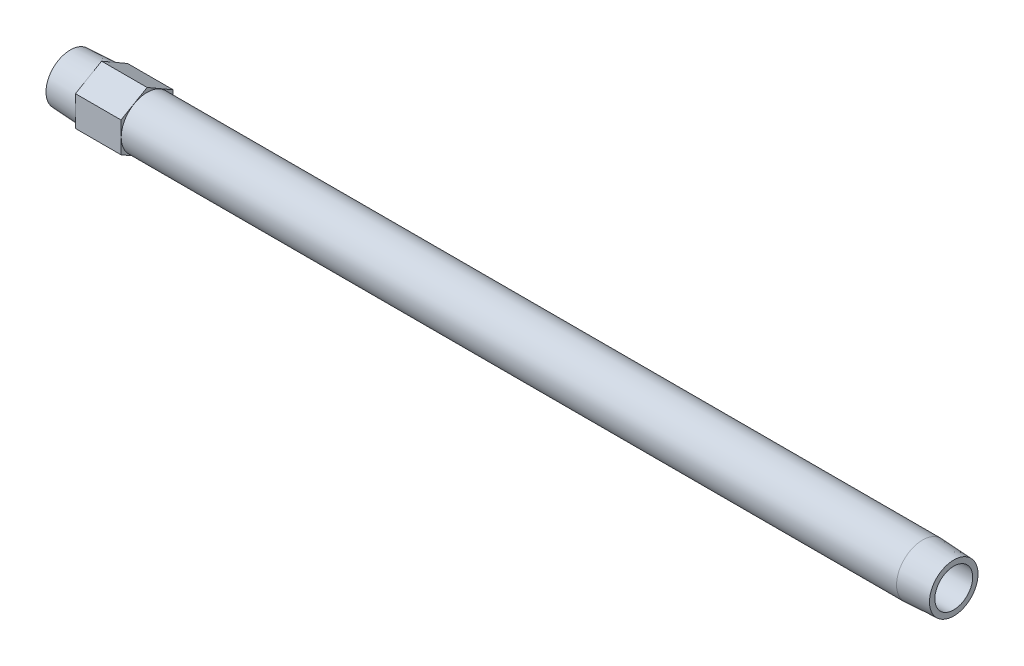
ISO-10303-21;
HEADER;
FILE_DESCRIPTION(('STEP AP214'),'2;1');
FILE_NAME('part.step','',(''),(''),'','','');
FILE_SCHEMA(('AUTOMOTIVE_DESIGN { 1 0 10303 214 1 1 1 1 }'));
ENDSEC;
DATA;
#1=APPLICATION_CONTEXT('core data for automotive mechanical design processes');
#2=APPLICATION_PROTOCOL_DEFINITION('international standard','automotive_design',2000,#1);
#3=PRODUCT_CONTEXT('',#1,'mechanical');
#4=PRODUCT('Part','Part','',(#3));
#5=PRODUCT_RELATED_PRODUCT_CATEGORY('part','',(#4));
#6=PRODUCT_DEFINITION_FORMATION('','',#4);
#7=PRODUCT_DEFINITION_CONTEXT('part definition',#1,'design');
#8=PRODUCT_DEFINITION('design','',#6,#7);
#9=PRODUCT_DEFINITION_SHAPE('','',#8);
#10=(LENGTH_UNIT() NAMED_UNIT(*) SI_UNIT(.MILLI.,.METRE.));
#11=(NAMED_UNIT(*) PLANE_ANGLE_UNIT() SI_UNIT($,.RADIAN.));
#12=(NAMED_UNIT(*) SI_UNIT($,.STERADIAN.) SOLID_ANGLE_UNIT());
#13=UNCERTAINTY_MEASURE_WITH_UNIT(LENGTH_MEASURE(1.E-05),#10,'distance_accuracy_value','');
#14=(GEOMETRIC_REPRESENTATION_CONTEXT(3) GLOBAL_UNCERTAINTY_ASSIGNED_CONTEXT((#13)) GLOBAL_UNIT_ASSIGNED_CONTEXT((#10,
#11,#12)) REPRESENTATION_CONTEXT('',''));
#15=CARTESIAN_POINT('',(0.,0.,0.));
#16=DIRECTION('',(0.,0.,1.));
#17=DIRECTION('',(1.,0.,0.));
#18=AXIS2_PLACEMENT_3D('',#15,#16,#17);
#19=CARTESIAN_POINT('',(0.,0.,-8.03071885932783));
#20=DIRECTION('',(1.,0.,0.));
#21=DIRECTION('',(0.,0.,-1.));
#22=AXIS2_PLACEMENT_3D('',#19,#20,#21);
#23=PLANE('',#22);
#24=CARTESIAN_POINT('',(0.,0.,0.));
#25=DIRECTION('',(-1.,0.,0.));
#26=DIRECTION('',(0.,0.,1.));
#27=AXIS2_PLACEMENT_3D('',#24,#25,#26);
#28=CIRCLE('',#27,8.03071885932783);
#29=CARTESIAN_POINT('',(0.,0.,8.03071885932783));
#30=VERTEX_POINT('',#29);
#31=EDGE_CURVE('E147',#30,#30,#28,.T.);
#32=ORIENTED_EDGE('',*,*,#31,.T.);
#33=EDGE_LOOP('',(#32));
#34=FACE_BOUND('',#33,.T.);
#35=CARTESIAN_POINT('',(0.,0.,0.));
#36=DIRECTION('',(1.,0.,0.));
#37=DIRECTION('',(0.,0.,1.));
#38=AXIS2_PLACEMENT_3D('',#35,#36,#37);
#39=CIRCLE('',#38,6.2611);
#40=CARTESIAN_POINT('',(0.,0.,6.2611));
#41=VERTEX_POINT('',#40);
#42=EDGE_CURVE('E159',#41,#41,#39,.T.);
#43=ORIENTED_EDGE('',*,*,#42,.T.);
#44=EDGE_LOOP('',(#43));
#45=FACE_BOUND('',#44,.T.);
#46=ADVANCED_FACE('F15',(#34,#45),#23,.F.);
#47=CARTESIAN_POINT('',(292.1,0.,-8.03071885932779));
#48=DIRECTION('',(-1.,0.,0.));
#49=DIRECTION('',(0.,0.,1.));
#50=AXIS2_PLACEMENT_3D('',#47,#48,#49);
#51=PLANE('',#50);
#52=CARTESIAN_POINT('',(292.1,0.,0.));
#53=DIRECTION('',(-1.,0.,0.));
#54=DIRECTION('',(0.,0.,1.));
#55=AXIS2_PLACEMENT_3D('',#52,#53,#54);
#56=CIRCLE('',#55,8.03071885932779);
#57=CARTESIAN_POINT('',(292.1,0.,8.03071885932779));
#58=VERTEX_POINT('',#57);
#59=EDGE_CURVE('E150',#58,#58,#56,.T.);
#60=ORIENTED_EDGE('',*,*,#59,.F.);
#61=EDGE_LOOP('',(#60));
#62=FACE_BOUND('',#61,.T.);
#63=CARTESIAN_POINT('',(292.1,0.,0.));
#64=DIRECTION('',(-1.,0.,0.));
#65=DIRECTION('',(0.,0.,1.));
#66=AXIS2_PLACEMENT_3D('',#63,#64,#65);
#67=CIRCLE('',#66,6.2611);
#68=CARTESIAN_POINT('',(292.1,0.,6.2611));
#69=VERTEX_POINT('',#68);
#70=EDGE_CURVE('E156',#69,#69,#67,.F.);
#71=ORIENTED_EDGE('',*,*,#70,.F.);
#72=EDGE_LOOP('',(#71));
#73=FACE_BOUND('',#72,.T.);
#74=ADVANCED_FACE('F178',(#62,#73),#51,.F.);
#75=CARTESIAN_POINT('',(25.4,-4.9859969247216,-8.636));
#76=DIRECTION('',(1.,0.,0.));
#77=DIRECTION('',(0.,1.,0.));
#78=AXIS2_PLACEMENT_3D('',#75,#76,#77);
#79=PLANE('',#78);
#80=DIRECTION('',(0.,0.5,-0.866025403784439));
#81=VECTOR('',#80,1.);
#82=CARTESIAN_POINT('',(25.4,-9.97199384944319,0.));
#83=LINE('',#82,#81);
#84=CARTESIAN_POINT('',(25.4,-9.97199384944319,0.));
#85=VERTEX_POINT('',#84);
#86=CARTESIAN_POINT('',(25.4,-4.9859969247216,-8.636));
#87=VERTEX_POINT('',#86);
#88=EDGE_CURVE('E103',#85,#87,#83,.T.);
#89=ORIENTED_EDGE('',*,*,#88,.T.);
#90=DIRECTION('',(0.,1.,0.));
#91=VECTOR('',#90,1.);
#92=CARTESIAN_POINT('',(25.4,-4.9859969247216,-8.636));
#93=LINE('',#92,#91);
#94=CARTESIAN_POINT('',(25.4,4.9859969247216,-8.636));
#95=VERTEX_POINT('',#94);
#96=EDGE_CURVE('E83',#87,#95,#93,.T.);
#97=ORIENTED_EDGE('',*,*,#96,.T.);
#98=DIRECTION('',(0.,0.5,0.866025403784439));
#99=VECTOR('',#98,1.);
#100=CARTESIAN_POINT('',(25.4,4.9859969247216,-8.636));
#101=LINE('',#100,#99);
#102=CARTESIAN_POINT('',(25.4,9.97199384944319,0.));
#103=VERTEX_POINT('',#102);
#104=EDGE_CURVE('E102',#95,#103,#101,.T.);
#105=ORIENTED_EDGE('',*,*,#104,.T.);
#106=DIRECTION('',(0.,-0.5,0.866025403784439));
#107=VECTOR('',#106,1.);
#108=CARTESIAN_POINT('',(25.4,9.97199384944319,0.));
#109=LINE('',#108,#107);
#110=CARTESIAN_POINT('',(25.4,4.9859969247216,8.636));
#111=VERTEX_POINT('',#110);
#112=EDGE_CURVE('E105',#103,#111,#109,.T.);
#113=ORIENTED_EDGE('',*,*,#112,.T.);
#114=DIRECTION('',(0.,-1.,0.));
#115=VECTOR('',#114,1.);
#116=CARTESIAN_POINT('',(25.4,4.9859969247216,8.636));
#117=LINE('',#116,#115);
#118=CARTESIAN_POINT('',(25.4,-4.9859969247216,8.636));
#119=VERTEX_POINT('',#118);
#120=EDGE_CURVE('E35',#111,#119,#117,.T.);
#121=ORIENTED_EDGE('',*,*,#120,.T.);
#122=DIRECTION('',(0.,-0.5,-0.866025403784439));
#123=VECTOR('',#122,1.);
#124=CARTESIAN_POINT('',(25.4,-4.9859969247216,8.636));
#125=LINE('',#124,#123);
#126=EDGE_CURVE('E30',#119,#85,#125,.T.);
#127=ORIENTED_EDGE('',*,*,#126,.T.);
#128=EDGE_LOOP('',(#89,#97,#105,#113,#121,#127));
#129=FACE_BOUND('',#128,.T.);
#130=CARTESIAN_POINT('',(25.4,0.,0.));
#131=DIRECTION('',(1.,0.,0.));
#132=DIRECTION('',(0.,1.,0.));
#133=AXIS2_PLACEMENT_3D('',#130,#131,#132);
#134=CIRCLE('',#133,8.5725);
#135=CARTESIAN_POINT('',(25.4,8.5725,0.));
#136=VERTEX_POINT('',#135);
#137=EDGE_CURVE('E89',#136,#136,#134,.F.);
#138=ORIENTED_EDGE('',*,*,#137,.T.);
#139=EDGE_LOOP('',(#138));
#140=FACE_BOUND('',#139,.T.);
#141=ADVANCED_FACE('F124',(#129,#140),#79,.T.);
#142=CARTESIAN_POINT('',(10.3378,-4.9859969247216,-8.636));
#143=DIRECTION('',(1.,0.,0.));
#144=DIRECTION('',(0.,1.,0.));
#145=AXIS2_PLACEMENT_3D('',#142,#143,#144);
#146=PLANE('',#145);
#147=DIRECTION('',(0.,0.5,-0.866025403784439));
#148=VECTOR('',#147,1.);
#149=CARTESIAN_POINT('',(10.3378,-9.97199384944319,0.));
#150=LINE('',#149,#148);
#151=CARTESIAN_POINT('',(10.3378,-9.97199384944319,0.));
#152=VERTEX_POINT('',#151);
#153=CARTESIAN_POINT('',(10.3378,-4.9859969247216,-8.636));
#154=VERTEX_POINT('',#153);
#155=EDGE_CURVE('E73',#152,#154,#150,.T.);
#156=ORIENTED_EDGE('',*,*,#155,.F.);
#157=DIRECTION('',(0.,-0.5,-0.866025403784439));
#158=VECTOR('',#157,1.);
#159=CARTESIAN_POINT('',(10.3378,-4.9859969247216,8.636));
#160=LINE('',#159,#158);
#161=CARTESIAN_POINT('',(10.3378,-4.9859969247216,8.636));
#162=VERTEX_POINT('',#161);
#163=EDGE_CURVE('E99',#162,#152,#160,.T.);
#164=ORIENTED_EDGE('',*,*,#163,.F.);
#165=DIRECTION('',(0.,-1.,0.));
#166=VECTOR('',#165,1.);
#167=CARTESIAN_POINT('',(10.3378,4.9859969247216,8.636));
#168=LINE('',#167,#166);
#169=CARTESIAN_POINT('',(10.3378,4.9859969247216,8.636));
#170=VERTEX_POINT('',#169);
#171=EDGE_CURVE('E133',#170,#162,#168,.T.);
#172=ORIENTED_EDGE('',*,*,#171,.F.);
#173=DIRECTION('',(0.,-0.5,0.866025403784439));
#174=VECTOR('',#173,1.);
#175=CARTESIAN_POINT('',(10.3378,9.97199384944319,0.));
#176=LINE('',#175,#174);
#177=CARTESIAN_POINT('',(10.3378,9.97199384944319,0.));
#178=VERTEX_POINT('',#177);
#179=EDGE_CURVE('E129',#178,#170,#176,.T.);
#180=ORIENTED_EDGE('',*,*,#179,.F.);
#181=DIRECTION('',(0.,0.5,0.866025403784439));
#182=VECTOR('',#181,1.);
#183=CARTESIAN_POINT('',(10.3378,4.9859969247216,-8.636));
#184=LINE('',#183,#182);
#185=CARTESIAN_POINT('',(10.3378,4.9859969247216,-8.636));
#186=VERTEX_POINT('',#185);
#187=EDGE_CURVE('E75',#186,#178,#184,.T.);
#188=ORIENTED_EDGE('',*,*,#187,.F.);
#189=DIRECTION('',(0.,1.,0.));
#190=VECTOR('',#189,1.);
#191=CARTESIAN_POINT('',(10.3378,-4.9859969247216,-8.636));
#192=LINE('',#191,#190);
#193=EDGE_CURVE('E68',#154,#186,#192,.T.);
#194=ORIENTED_EDGE('',*,*,#193,.F.);
#195=EDGE_LOOP('',(#156,#164,#172,#180,#188,#194));
#196=FACE_BOUND('',#195,.T.);
#197=CARTESIAN_POINT('',(10.3378,0.,0.));
#198=DIRECTION('',(-1.,0.,0.));
#199=DIRECTION('',(0.,0.,1.));
#200=AXIS2_PLACEMENT_3D('',#197,#198,#199);
#201=CIRCLE('',#200,8.5725);
#202=CARTESIAN_POINT('',(10.3378,0.,8.5725));
#203=VERTEX_POINT('',#202);
#204=EDGE_CURVE('E95',#203,#203,#201,.T.);
#205=ORIENTED_EDGE('',*,*,#204,.F.);
#206=EDGE_LOOP('',(#205));
#207=FACE_BOUND('',#206,.T.);
#208=ADVANCED_FACE('F69',(#196,#207),#146,.F.);
#209=CARTESIAN_POINT('',(25.4,-9.97199384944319,0.));
#210=DIRECTION('',(0.,0.866025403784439,0.5));
#211=DIRECTION('',(0.,-0.5,0.866025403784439));
#212=AXIS2_PLACEMENT_3D('',#209,#210,#211);
#213=PLANE('',#212);
#214=ORIENTED_EDGE('',*,*,#155,.T.);
#215=DIRECTION('',(-1.,0.,0.));
#216=VECTOR('',#215,1.);
#217=CARTESIAN_POINT('',(25.4,-4.9859969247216,-8.636));
#218=LINE('',#217,#216);
#219=EDGE_CURVE('E10',#87,#154,#218,.T.);
#220=ORIENTED_EDGE('',*,*,#219,.F.);
#221=ORIENTED_EDGE('',*,*,#88,.F.);
#222=DIRECTION('',(-1.,0.,0.));
#223=VECTOR('',#222,1.);
#224=CARTESIAN_POINT('',(25.4,-9.97199384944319,0.));
#225=LINE('',#224,#223);
#226=EDGE_CURVE('E87',#85,#152,#225,.T.);
#227=ORIENTED_EDGE('',*,*,#226,.T.);
#228=EDGE_LOOP('',(#214,#220,#221,#227));
#229=FACE_BOUND('',#228,.T.);
#230=ADVANCED_FACE('F17',(#229),#213,.F.);
#231=CARTESIAN_POINT('',(25.4,-4.9859969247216,-8.636));
#232=DIRECTION('',(0.,0.,1.));
#233=DIRECTION('',(1.,0.,0.));
#234=AXIS2_PLACEMENT_3D('',#231,#232,#233);
#235=PLANE('',#234);
#236=ORIENTED_EDGE('',*,*,#193,.T.);
#237=DIRECTION('',(-1.,0.,0.));
#238=VECTOR('',#237,1.);
#239=CARTESIAN_POINT('',(25.4,4.9859969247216,-8.636));
#240=LINE('',#239,#238);
#241=EDGE_CURVE('E23',#95,#186,#240,.T.);
#242=ORIENTED_EDGE('',*,*,#241,.F.);
#243=ORIENTED_EDGE('',*,*,#96,.F.);
#244=ORIENTED_EDGE('',*,*,#219,.T.);
#245=EDGE_LOOP('',(#236,#242,#243,#244));
#246=FACE_BOUND('',#245,.T.);
#247=ADVANCED_FACE('F82',(#246),#235,.F.);
#248=CARTESIAN_POINT('',(25.4,4.9859969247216,-8.636));
#249=DIRECTION('',(0.,-0.866025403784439,0.5));
#250=DIRECTION('',(0.,-0.5,-0.866025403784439));
#251=AXIS2_PLACEMENT_3D('',#248,#249,#250);
#252=PLANE('',#251);
#253=ORIENTED_EDGE('',*,*,#187,.T.);
#254=DIRECTION('',(-1.,0.,0.));
#255=VECTOR('',#254,1.);
#256=CARTESIAN_POINT('',(25.4,9.97199384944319,0.));
#257=LINE('',#256,#255);
#258=EDGE_CURVE('E117',#103,#178,#257,.T.);
#259=ORIENTED_EDGE('',*,*,#258,.F.);
#260=ORIENTED_EDGE('',*,*,#104,.F.);
#261=ORIENTED_EDGE('',*,*,#241,.T.);
#262=EDGE_LOOP('',(#253,#259,#260,#261));
#263=FACE_BOUND('',#262,.T.);
#264=ADVANCED_FACE('F121',(#263),#252,.F.);
#265=CARTESIAN_POINT('',(25.4,9.97199384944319,0.));
#266=DIRECTION('',(0.,-0.866025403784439,-0.5));
#267=DIRECTION('',(0.,0.5,-0.866025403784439));
#268=AXIS2_PLACEMENT_3D('',#265,#266,#267);
#269=PLANE('',#268);
#270=ORIENTED_EDGE('',*,*,#179,.T.);
#271=DIRECTION('',(-1.,0.,0.));
#272=VECTOR('',#271,1.);
#273=CARTESIAN_POINT('',(25.4,4.9859969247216,8.636));
#274=LINE('',#273,#272);
#275=EDGE_CURVE('E114',#111,#170,#274,.T.);
#276=ORIENTED_EDGE('',*,*,#275,.F.);
#277=ORIENTED_EDGE('',*,*,#112,.F.);
#278=ORIENTED_EDGE('',*,*,#258,.T.);
#279=EDGE_LOOP('',(#270,#276,#277,#278));
#280=FACE_BOUND('',#279,.T.);
#281=ADVANCED_FACE('F128',(#280),#269,.F.);
#282=CARTESIAN_POINT('',(25.4,4.9859969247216,8.636));
#283=DIRECTION('',(0.,0.,-1.));
#284=DIRECTION('',(-1.,0.,0.));
#285=AXIS2_PLACEMENT_3D('',#282,#283,#284);
#286=PLANE('',#285);
#287=ORIENTED_EDGE('',*,*,#171,.T.);
#288=DIRECTION('',(-1.,0.,0.));
#289=VECTOR('',#288,1.);
#290=CARTESIAN_POINT('',(25.4,-4.9859969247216,8.636));
#291=LINE('',#290,#289);
#292=EDGE_CURVE('E111',#119,#162,#291,.T.);
#293=ORIENTED_EDGE('',*,*,#292,.F.);
#294=ORIENTED_EDGE('',*,*,#120,.F.);
#295=ORIENTED_EDGE('',*,*,#275,.T.);
#296=EDGE_LOOP('',(#287,#293,#294,#295));
#297=FACE_BOUND('',#296,.T.);
#298=ADVANCED_FACE('F132',(#297),#286,.F.);
#299=CARTESIAN_POINT('',(25.4,-4.9859969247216,8.636));
#300=DIRECTION('',(0.,0.866025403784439,-0.5));
#301=DIRECTION('',(0.,0.5,0.866025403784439));
#302=AXIS2_PLACEMENT_3D('',#299,#300,#301);
#303=PLANE('',#302);
#304=ORIENTED_EDGE('',*,*,#163,.T.);
#305=ORIENTED_EDGE('',*,*,#226,.F.);
#306=ORIENTED_EDGE('',*,*,#126,.F.);
#307=ORIENTED_EDGE('',*,*,#292,.T.);
#308=EDGE_LOOP('',(#304,#305,#306,#307));
#309=FACE_BOUND('',#308,.T.);
#310=ADVANCED_FACE('F135',(#309),#303,.F.);
#311=CARTESIAN_POINT('',(10.3378,0.,0.));
#312=DIRECTION('',(1.,0.,0.));
#313=DIRECTION('',(0.,0.,-1.));
#314=AXIS2_PLACEMENT_3D('',#311,#312,#313);
#315=CONICAL_SURFACE('',#314,8.5725,0.0523598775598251);
#316=ORIENTED_EDGE('',*,*,#31,.F.);
#317=EDGE_LOOP('',(#316));
#318=FACE_BOUND('',#317,.T.);
#319=ORIENTED_EDGE('',*,*,#204,.T.);
#320=EDGE_LOOP('',(#319));
#321=FACE_BOUND('',#320,.T.);
#322=ADVANCED_FACE('F187',(#318,#321),#315,.T.);
#323=CARTESIAN_POINT('',(-60.,0.,0.));
#324=DIRECTION('',(-1.,0.,0.));
#325=DIRECTION('',(0.,0.,1.));
#326=AXIS2_PLACEMENT_3D('',#323,#324,#325);
#327=CYLINDRICAL_SURFACE('',#326,8.5725);
#328=ORIENTED_EDGE('',*,*,#137,.F.);
#329=EDGE_LOOP('',(#328));
#330=FACE_BOUND('',#329,.T.);
#331=CARTESIAN_POINT('',(281.7622,0.,0.));
#332=DIRECTION('',(-1.,0.,0.));
#333=DIRECTION('',(0.,0.,1.));
#334=AXIS2_PLACEMENT_3D('',#331,#332,#333);
#335=CIRCLE('',#334,8.5725);
#336=CARTESIAN_POINT('',(281.7622,0.,8.5725));
#337=VERTEX_POINT('',#336);
#338=EDGE_CURVE('E153',#337,#337,#335,.T.);
#339=ORIENTED_EDGE('',*,*,#338,.T.);
#340=EDGE_LOOP('',(#339));
#341=FACE_BOUND('',#340,.T.);
#342=ADVANCED_FACE('F174',(#330,#341),#327,.T.);
#343=CARTESIAN_POINT('',(292.1,0.,0.));
#344=DIRECTION('',(-1.,0.,0.));
#345=DIRECTION('',(0.,0.,1.));
#346=AXIS2_PLACEMENT_3D('',#343,#344,#345);
#347=CONICAL_SURFACE('',#346,8.03071885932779,0.052359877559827);
#348=ORIENTED_EDGE('',*,*,#338,.F.);
#349=EDGE_LOOP('',(#348));
#350=FACE_BOUND('',#349,.T.);
#351=ORIENTED_EDGE('',*,*,#59,.T.);
#352=EDGE_LOOP('',(#351));
#353=FACE_BOUND('',#352,.T.);
#354=ADVANCED_FACE('F167',(#350,#353),#347,.T.);
#355=CARTESIAN_POINT('',(293.289097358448,0.,0.));
#356=DIRECTION('',(-1.,0.,0.));
#357=DIRECTION('',(0.,0.,1.));
#358=AXIS2_PLACEMENT_3D('',#355,#356,#357);
#359=CYLINDRICAL_SURFACE('',#358,6.2611);
#360=ORIENTED_EDGE('',*,*,#70,.T.);
#361=EDGE_LOOP('',(#360));
#362=FACE_BOUND('',#361,.T.);
#363=ORIENTED_EDGE('',*,*,#42,.F.);
#364=EDGE_LOOP('',(#363));
#365=FACE_BOUND('',#364,.T.);
#366=ADVANCED_FACE('F165',(#362,#365),#359,.F.);
#367=CLOSED_SHELL('',(#46,#74,#141,#208,#230,#247,#264,#281,#298,#310,#322,#342,#354,#366));
#368=MANIFOLD_SOLID_BREP('B1',#367);
#369=ADVANCED_BREP_SHAPE_REPRESENTATION('',(#18,#368),#14);
#370=SHAPE_DEFINITION_REPRESENTATION(#9,#369);
ENDSEC;
END-ISO-10303-21;
